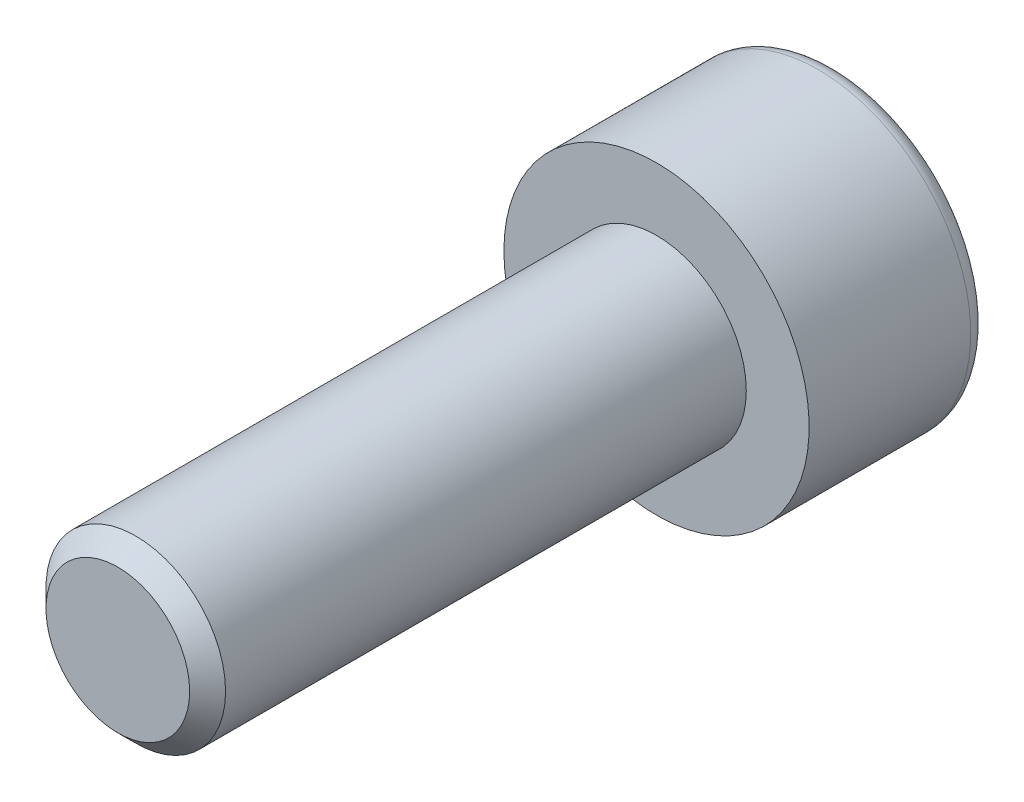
ISO-10303-21;
HEADER;
FILE_DESCRIPTION(('STEP AP214'),'2;1');
FILE_NAME('part.step','',(''),(''),'','','');
FILE_SCHEMA(('AUTOMOTIVE_DESIGN { 1 0 10303 214 1 1 1 1 }'));
ENDSEC;
DATA;
#1=APPLICATION_CONTEXT('core data for automotive mechanical design processes');
#2=APPLICATION_PROTOCOL_DEFINITION('international standard','automotive_design',2000,#1);
#3=PRODUCT_CONTEXT('',#1,'mechanical');
#4=PRODUCT('Part','Part','',(#3));
#5=PRODUCT_RELATED_PRODUCT_CATEGORY('part','',(#4));
#6=PRODUCT_DEFINITION_FORMATION('','',#4);
#7=PRODUCT_DEFINITION_CONTEXT('part definition',#1,'design');
#8=PRODUCT_DEFINITION('design','',#6,#7);
#9=PRODUCT_DEFINITION_SHAPE('','',#8);
#10=(LENGTH_UNIT() NAMED_UNIT(*) SI_UNIT(.MILLI.,.METRE.));
#11=(NAMED_UNIT(*) PLANE_ANGLE_UNIT() SI_UNIT($,.RADIAN.));
#12=(NAMED_UNIT(*) SI_UNIT($,.STERADIAN.) SOLID_ANGLE_UNIT());
#13=UNCERTAINTY_MEASURE_WITH_UNIT(LENGTH_MEASURE(1.E-05),#10,'distance_accuracy_value','');
#14=(GEOMETRIC_REPRESENTATION_CONTEXT(3) GLOBAL_UNCERTAINTY_ASSIGNED_CONTEXT((#13)) GLOBAL_UNIT_ASSIGNED_CONTEXT((#10,
#11,#12)) REPRESENTATION_CONTEXT('',''));
#15=CARTESIAN_POINT('',(0.,0.,0.));
#16=DIRECTION('',(0.,0.,1.));
#17=DIRECTION('',(1.,0.,0.));
#18=AXIS2_PLACEMENT_3D('',#15,#16,#17);
#19=CARTESIAN_POINT('',(0.,0.,-5.));
#20=DIRECTION('',(0.,0.,1.));
#21=DIRECTION('',(1.,0.,0.));
#22=AXIS2_PLACEMENT_3D('',#19,#20,#21);
#23=PLANE('',#22);
#24=CARTESIAN_POINT('',(0.,0.,-5.));
#25=DIRECTION('',(0.,0.,-1.));
#26=DIRECTION('',(-1.,0.,0.));
#27=AXIS2_PLACEMENT_3D('',#24,#25,#26);
#28=CIRCLE('',#27,3.75);
#29=CARTESIAN_POINT('',(-3.75,0.,-5.));
#30=VERTEX_POINT('',#29);
#31=EDGE_CURVE('E143',#30,#30,#28,.T.);
#32=ORIENTED_EDGE('',*,*,#31,.T.);
#33=EDGE_LOOP('',(#32));
#34=FACE_BOUND('',#33,.T.);
#35=DIRECTION('',(-0.86602540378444,0.499999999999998,0.));
#36=VECTOR('',#35,1.);
#37=CARTESIAN_POINT('',(0.,2.30940107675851,-5.));
#38=LINE('',#37,#36);
#39=CARTESIAN_POINT('',(2.,1.15470053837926,-5.));
#40=VERTEX_POINT('',#39);
#41=CARTESIAN_POINT('',(0.,2.30940107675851,-5.));
#42=VERTEX_POINT('',#41);
#43=EDGE_CURVE('E47',#40,#42,#38,.T.);
#44=ORIENTED_EDGE('',*,*,#43,.T.);
#45=DIRECTION('',(-0.866025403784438,-0.500000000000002,0.));
#46=VECTOR('',#45,1.);
#47=CARTESIAN_POINT('',(0.,2.30940107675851,-5.));
#48=LINE('',#47,#46);
#49=CARTESIAN_POINT('',(-2.,1.15470053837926,-5.));
#50=VERTEX_POINT('',#49);
#51=EDGE_CURVE('E87',#42,#50,#48,.T.);
#52=ORIENTED_EDGE('',*,*,#51,.T.);
#53=DIRECTION('',(0.,-1.,0.));
#54=VECTOR('',#53,1.);
#55=CARTESIAN_POINT('',(-2.,-1.15470053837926,-5.));
#56=LINE('',#55,#54);
#57=CARTESIAN_POINT('',(-2.,-1.15470053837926,-5.));
#58=VERTEX_POINT('',#57);
#59=EDGE_CURVE('E95',#50,#58,#56,.T.);
#60=ORIENTED_EDGE('',*,*,#59,.T.);
#61=DIRECTION('',(0.866025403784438,-0.500000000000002,0.));
#62=VECTOR('',#61,1.);
#63=CARTESIAN_POINT('',(0.,-2.30940107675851,-5.));
#64=LINE('',#63,#62);
#65=CARTESIAN_POINT('',(0.,-2.30940107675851,-5.));
#66=VERTEX_POINT('',#65);
#67=EDGE_CURVE('E113',#58,#66,#64,.T.);
#68=ORIENTED_EDGE('',*,*,#67,.T.);
#69=DIRECTION('',(0.86602540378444,0.499999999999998,0.));
#70=VECTOR('',#69,1.);
#71=CARTESIAN_POINT('',(0.,-2.30940107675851,-5.));
#72=LINE('',#71,#70);
#73=CARTESIAN_POINT('',(2.,-1.15470053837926,-5.));
#74=VERTEX_POINT('',#73);
#75=EDGE_CURVE('E116',#66,#74,#72,.T.);
#76=ORIENTED_EDGE('',*,*,#75,.T.);
#77=DIRECTION('',(0.,1.,0.));
#78=VECTOR('',#77,1.);
#79=CARTESIAN_POINT('',(2.,-1.15470053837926,-5.));
#80=LINE('',#79,#78);
#81=EDGE_CURVE('E106',#74,#40,#80,.T.);
#82=ORIENTED_EDGE('',*,*,#81,.T.);
#83=EDGE_LOOP('',(#44,#52,#60,#68,#76,#82));
#84=FACE_BOUND('',#83,.T.);
#85=ADVANCED_FACE('F33',(#34,#84),#23,.F.);
#86=CARTESIAN_POINT('',(0.,0.,-4.5));
#87=DIRECTION('',(0.,0.,-1.));
#88=DIRECTION('',(-1.,0.,0.));
#89=AXIS2_PLACEMENT_3D('',#86,#87,#88);
#90=TOROIDAL_SURFACE('',#89,3.75,0.5);
#91=ORIENTED_EDGE('',*,*,#31,.F.);
#92=EDGE_LOOP('',(#91));
#93=FACE_BOUND('',#92,.T.);
#94=CARTESIAN_POINT('',(0.,0.,-4.5));
#95=DIRECTION('',(0.,0.,-1.));
#96=DIRECTION('',(-1.,0.,0.));
#97=AXIS2_PLACEMENT_3D('',#94,#95,#96);
#98=CIRCLE('',#97,4.25);
#99=CARTESIAN_POINT('',(-4.25,0.,-4.5));
#100=VERTEX_POINT('',#99);
#101=EDGE_CURVE('E140',#100,#100,#98,.T.);
#102=ORIENTED_EDGE('',*,*,#101,.T.);
#103=EDGE_LOOP('',(#102));
#104=FACE_BOUND('',#103,.T.);
#105=ADVANCED_FACE('F162',(#93,#104),#90,.T.);
#106=CARTESIAN_POINT('',(0.,0.,0.));
#107=DIRECTION('',(0.,0.,-1.));
#108=DIRECTION('',(-1.,0.,0.));
#109=AXIS2_PLACEMENT_3D('',#106,#107,#108);
#110=CYLINDRICAL_SURFACE('',#109,4.25);
#111=ORIENTED_EDGE('',*,*,#101,.F.);
#112=EDGE_LOOP('',(#111));
#113=FACE_BOUND('',#112,.T.);
#114=CARTESIAN_POINT('',(0.,0.,0.));
#115=DIRECTION('',(0.,0.,-1.));
#116=DIRECTION('',(-1.,0.,0.));
#117=AXIS2_PLACEMENT_3D('',#114,#115,#116);
#118=CIRCLE('',#117,4.25);
#119=CARTESIAN_POINT('',(-4.25,0.,0.));
#120=VERTEX_POINT('',#119);
#121=EDGE_CURVE('E101',#120,#120,#118,.T.);
#122=ORIENTED_EDGE('',*,*,#121,.T.);
#123=EDGE_LOOP('',(#122));
#124=FACE_BOUND('',#123,.T.);
#125=ADVANCED_FACE('F167',(#113,#124),#110,.T.);
#126=CARTESIAN_POINT('',(0.,0.,0.));
#127=DIRECTION('',(0.,0.,-1.));
#128=DIRECTION('',(-1.,0.,0.));
#129=AXIS2_PLACEMENT_3D('',#126,#127,#128);
#130=PLANE('',#129);
#131=CARTESIAN_POINT('',(0.,0.,0.));
#132=DIRECTION('',(0.,0.,1.));
#133=DIRECTION('',(1.,0.,0.));
#134=AXIS2_PLACEMENT_3D('',#131,#132,#133);
#135=CIRCLE('',#134,2.5);
#136=CARTESIAN_POINT('',(2.5,0.,0.));
#137=VERTEX_POINT('',#136);
#138=EDGE_CURVE('E107',#137,#137,#135,.T.);
#139=ORIENTED_EDGE('',*,*,#138,.F.);
#140=EDGE_LOOP('',(#139));
#141=FACE_BOUND('',#140,.T.);
#142=ORIENTED_EDGE('',*,*,#121,.F.);
#143=EDGE_LOOP('',(#142));
#144=FACE_BOUND('',#143,.T.);
#145=ADVANCED_FACE('F175',(#141,#144),#130,.F.);
#146=CARTESIAN_POINT('',(0.,2.30940107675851,-2.5));
#147=DIRECTION('',(-0.499999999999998,-0.86602540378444,0.));
#148=DIRECTION('',(0.86602540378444,-0.499999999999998,0.));
#149=AXIS2_PLACEMENT_3D('',#146,#147,#148);
#150=PLANE('',#149);
#151=ORIENTED_EDGE('',*,*,#43,.F.);
#152=DIRECTION('',(0.,0.,-1.));
#153=VECTOR('',#152,1.);
#154=CARTESIAN_POINT('',(2.,1.15470053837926,-2.5));
#155=LINE('',#154,#153);
#156=CARTESIAN_POINT('',(2.,1.15470053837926,-2.5));
#157=VERTEX_POINT('',#156);
#158=EDGE_CURVE('E129',#157,#40,#155,.T.);
#159=ORIENTED_EDGE('',*,*,#158,.F.);
#160=DIRECTION('',(-0.86602540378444,0.499999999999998,0.));
#161=VECTOR('',#160,1.);
#162=CARTESIAN_POINT('',(0.,2.30940107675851,-2.5));
#163=LINE('',#162,#161);
#164=CARTESIAN_POINT('',(0.,2.30940107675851,-2.5));
#165=VERTEX_POINT('',#164);
#166=EDGE_CURVE('E100',#157,#165,#163,.T.);
#167=ORIENTED_EDGE('',*,*,#166,.T.);
#168=DIRECTION('',(0.,0.,-1.));
#169=VECTOR('',#168,1.);
#170=CARTESIAN_POINT('',(0.,2.30940107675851,-2.5));
#171=LINE('',#170,#169);
#172=EDGE_CURVE('E89',#165,#42,#171,.T.);
#173=ORIENTED_EDGE('',*,*,#172,.T.);
#174=EDGE_LOOP('',(#151,#159,#167,#173));
#175=FACE_BOUND('',#174,.T.);
#176=ADVANCED_FACE('F98',(#175),#150,.T.);
#177=CARTESIAN_POINT('',(0.,2.30940107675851,-2.5));
#178=DIRECTION('',(0.500000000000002,-0.866025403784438,0.));
#179=DIRECTION('',(0.866025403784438,0.500000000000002,0.));
#180=AXIS2_PLACEMENT_3D('',#177,#178,#179);
#181=PLANE('',#180);
#182=ORIENTED_EDGE('',*,*,#51,.F.);
#183=ORIENTED_EDGE('',*,*,#172,.F.);
#184=DIRECTION('',(-0.866025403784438,-0.500000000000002,0.));
#185=VECTOR('',#184,1.);
#186=CARTESIAN_POINT('',(0.,2.30940107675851,-2.5));
#187=LINE('',#186,#185);
#188=CARTESIAN_POINT('',(-2.,1.15470053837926,-2.5));
#189=VERTEX_POINT('',#188);
#190=EDGE_CURVE('E120',#165,#189,#187,.T.);
#191=ORIENTED_EDGE('',*,*,#190,.T.);
#192=DIRECTION('',(0.,0.,-1.));
#193=VECTOR('',#192,1.);
#194=CARTESIAN_POINT('',(-2.,1.15470053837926,-2.5));
#195=LINE('',#194,#193);
#196=EDGE_CURVE('E91',#189,#50,#195,.T.);
#197=ORIENTED_EDGE('',*,*,#196,.T.);
#198=EDGE_LOOP('',(#182,#183,#191,#197));
#199=FACE_BOUND('',#198,.T.);
#200=ADVANCED_FACE('F88',(#199),#181,.T.);
#201=CARTESIAN_POINT('',(-2.,-1.15470053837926,-2.5));
#202=DIRECTION('',(1.,0.,0.));
#203=DIRECTION('',(0.,0.,-1.));
#204=AXIS2_PLACEMENT_3D('',#201,#202,#203);
#205=PLANE('',#204);
#206=ORIENTED_EDGE('',*,*,#59,.F.);
#207=ORIENTED_EDGE('',*,*,#196,.F.);
#208=DIRECTION('',(0.,-1.,0.));
#209=VECTOR('',#208,1.);
#210=CARTESIAN_POINT('',(-2.,-1.15470053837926,-2.5));
#211=LINE('',#210,#209);
#212=CARTESIAN_POINT('',(-2.,-1.15470053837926,-2.5));
#213=VERTEX_POINT('',#212);
#214=EDGE_CURVE('E122',#189,#213,#211,.T.);
#215=ORIENTED_EDGE('',*,*,#214,.T.);
#216=DIRECTION('',(0.,0.,-1.));
#217=VECTOR('',#216,1.);
#218=CARTESIAN_POINT('',(-2.,-1.15470053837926,-2.5));
#219=LINE('',#218,#217);
#220=EDGE_CURVE('E135',#213,#58,#219,.T.);
#221=ORIENTED_EDGE('',*,*,#220,.T.);
#222=EDGE_LOOP('',(#206,#207,#215,#221));
#223=FACE_BOUND('',#222,.T.);
#224=ADVANCED_FACE('F190',(#223),#205,.T.);
#225=CARTESIAN_POINT('',(0.,-2.30940107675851,-2.5));
#226=DIRECTION('',(0.500000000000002,0.866025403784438,0.));
#227=DIRECTION('',(-0.866025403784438,0.500000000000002,0.));
#228=AXIS2_PLACEMENT_3D('',#225,#226,#227);
#229=PLANE('',#228);
#230=ORIENTED_EDGE('',*,*,#67,.F.);
#231=ORIENTED_EDGE('',*,*,#220,.F.);
#232=DIRECTION('',(0.866025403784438,-0.500000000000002,0.));
#233=VECTOR('',#232,1.);
#234=CARTESIAN_POINT('',(0.,-2.30940107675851,-2.5));
#235=LINE('',#234,#233);
#236=CARTESIAN_POINT('',(0.,-2.30940107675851,-2.5));
#237=VERTEX_POINT('',#236);
#238=EDGE_CURVE('E124',#213,#237,#235,.T.);
#239=ORIENTED_EDGE('',*,*,#238,.T.);
#240=DIRECTION('',(0.,0.,-1.));
#241=VECTOR('',#240,1.);
#242=CARTESIAN_POINT('',(0.,-2.30940107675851,-2.5));
#243=LINE('',#242,#241);
#244=EDGE_CURVE('E133',#237,#66,#243,.T.);
#245=ORIENTED_EDGE('',*,*,#244,.T.);
#246=EDGE_LOOP('',(#230,#231,#239,#245));
#247=FACE_BOUND('',#246,.T.);
#248=ADVANCED_FACE('F193',(#247),#229,.T.);
#249=CARTESIAN_POINT('',(0.,-2.30940107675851,-2.5));
#250=DIRECTION('',(-0.499999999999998,0.86602540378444,0.));
#251=DIRECTION('',(-0.86602540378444,-0.499999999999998,0.));
#252=AXIS2_PLACEMENT_3D('',#249,#250,#251);
#253=PLANE('',#252);
#254=ORIENTED_EDGE('',*,*,#75,.F.);
#255=ORIENTED_EDGE('',*,*,#244,.F.);
#256=DIRECTION('',(0.86602540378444,0.499999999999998,0.));
#257=VECTOR('',#256,1.);
#258=CARTESIAN_POINT('',(0.,-2.30940107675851,-2.5));
#259=LINE('',#258,#257);
#260=CARTESIAN_POINT('',(2.,-1.15470053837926,-2.5));
#261=VERTEX_POINT('',#260);
#262=EDGE_CURVE('E126',#237,#261,#259,.T.);
#263=ORIENTED_EDGE('',*,*,#262,.T.);
#264=DIRECTION('',(0.,0.,-1.));
#265=VECTOR('',#264,1.);
#266=CARTESIAN_POINT('',(2.,-1.15470053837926,-2.5));
#267=LINE('',#266,#265);
#268=EDGE_CURVE('E131',#261,#74,#267,.T.);
#269=ORIENTED_EDGE('',*,*,#268,.T.);
#270=EDGE_LOOP('',(#254,#255,#263,#269));
#271=FACE_BOUND('',#270,.T.);
#272=ADVANCED_FACE('F197',(#271),#253,.T.);
#273=CARTESIAN_POINT('',(2.,-1.15470053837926,-2.5));
#274=DIRECTION('',(-1.,0.,0.));
#275=DIRECTION('',(0.,0.,1.));
#276=AXIS2_PLACEMENT_3D('',#273,#274,#275);
#277=PLANE('',#276);
#278=ORIENTED_EDGE('',*,*,#81,.F.);
#279=ORIENTED_EDGE('',*,*,#268,.F.);
#280=DIRECTION('',(0.,1.,0.));
#281=VECTOR('',#280,1.);
#282=CARTESIAN_POINT('',(2.,-1.15470053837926,-2.5));
#283=LINE('',#282,#281);
#284=EDGE_CURVE('E54',#261,#157,#283,.T.);
#285=ORIENTED_EDGE('',*,*,#284,.T.);
#286=ORIENTED_EDGE('',*,*,#158,.T.);
#287=EDGE_LOOP('',(#278,#279,#285,#286));
#288=FACE_BOUND('',#287,.T.);
#289=ADVANCED_FACE('F201',(#288),#277,.T.);
#290=CARTESIAN_POINT('',(2.,1.15470053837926,-2.5));
#291=DIRECTION('',(0.,0.,1.));
#292=DIRECTION('',(1.,0.,0.));
#293=AXIS2_PLACEMENT_3D('',#290,#291,#292);
#294=PLANE('',#293);
#295=ORIENTED_EDGE('',*,*,#166,.F.);
#296=ORIENTED_EDGE('',*,*,#284,.F.);
#297=ORIENTED_EDGE('',*,*,#262,.F.);
#298=ORIENTED_EDGE('',*,*,#238,.F.);
#299=ORIENTED_EDGE('',*,*,#214,.F.);
#300=ORIENTED_EDGE('',*,*,#190,.F.);
#301=EDGE_LOOP('',(#295,#296,#297,#298,#299,#300));
#302=FACE_BOUND('',#301,.T.);
#303=ADVANCED_FACE('F205',(#302),#294,.F.);
#304=CARTESIAN_POINT('',(0.,0.,15.));
#305=DIRECTION('',(0.,0.,1.));
#306=DIRECTION('',(1.,0.,0.));
#307=AXIS2_PLACEMENT_3D('',#304,#305,#306);
#308=PLANE('',#307);
#309=CARTESIAN_POINT('',(0.,0.,15.));
#310=DIRECTION('',(0.,0.,1.));
#311=DIRECTION('',(1.,0.,0.));
#312=AXIS2_PLACEMENT_3D('',#309,#310,#311);
#313=CIRCLE('',#312,2.);
#314=CARTESIAN_POINT('',(2.,0.,15.));
#315=VERTEX_POINT('',#314);
#316=EDGE_CURVE('E40',#315,#315,#313,.T.);
#317=ORIENTED_EDGE('',*,*,#316,.T.);
#318=EDGE_LOOP('',(#317));
#319=FACE_BOUND('',#318,.T.);
#320=ADVANCED_FACE('F148',(#319),#308,.T.);
#321=CARTESIAN_POINT('',(0.,0.,0.));
#322=DIRECTION('',(0.,0.,1.));
#323=DIRECTION('',(1.,0.,0.));
#324=AXIS2_PLACEMENT_3D('',#321,#322,#323);
#325=CYLINDRICAL_SURFACE('',#324,2.5);
#326=CARTESIAN_POINT('',(0.,0.,14.5));
#327=DIRECTION('',(0.,0.,1.));
#328=DIRECTION('',(1.,0.,0.));
#329=AXIS2_PLACEMENT_3D('',#326,#327,#328);
#330=CIRCLE('',#329,2.5);
#331=CARTESIAN_POINT('',(2.5,0.,14.5));
#332=VERTEX_POINT('',#331);
#333=EDGE_CURVE('E11',#332,#332,#330,.F.);
#334=ORIENTED_EDGE('',*,*,#333,.T.);
#335=EDGE_LOOP('',(#334));
#336=FACE_BOUND('',#335,.T.);
#337=ORIENTED_EDGE('',*,*,#138,.T.);
#338=EDGE_LOOP('',(#337));
#339=FACE_BOUND('',#338,.T.);
#340=ADVANCED_FACE('F152',(#336,#339),#325,.T.);
#341=CARTESIAN_POINT('',(0.,0.,15.));
#342=DIRECTION('',(0.,0.,-1.));
#343=DIRECTION('',(-1.,0.,0.));
#344=AXIS2_PLACEMENT_3D('',#341,#342,#343);
#345=CONICAL_SURFACE('',#344,2.,0.785398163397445);
#346=ORIENTED_EDGE('',*,*,#333,.F.);
#347=EDGE_LOOP('',(#346));
#348=FACE_BOUND('',#347,.T.);
#349=ORIENTED_EDGE('',*,*,#316,.F.);
#350=EDGE_LOOP('',(#349));
#351=FACE_BOUND('',#350,.T.);
#352=ADVANCED_FACE('F150',(#348,#351),#345,.T.);
#353=CLOSED_SHELL('',(#85,#105,#125,#145,#176,#200,#224,#248,#272,#289,#303,#320,#340,#352));
#354=MANIFOLD_SOLID_BREP('B2',#353);
#355=ADVANCED_BREP_SHAPE_REPRESENTATION('',(#18,#354),#14);
#356=SHAPE_DEFINITION_REPRESENTATION(#9,#355);
ENDSEC;
END-ISO-10303-21;
